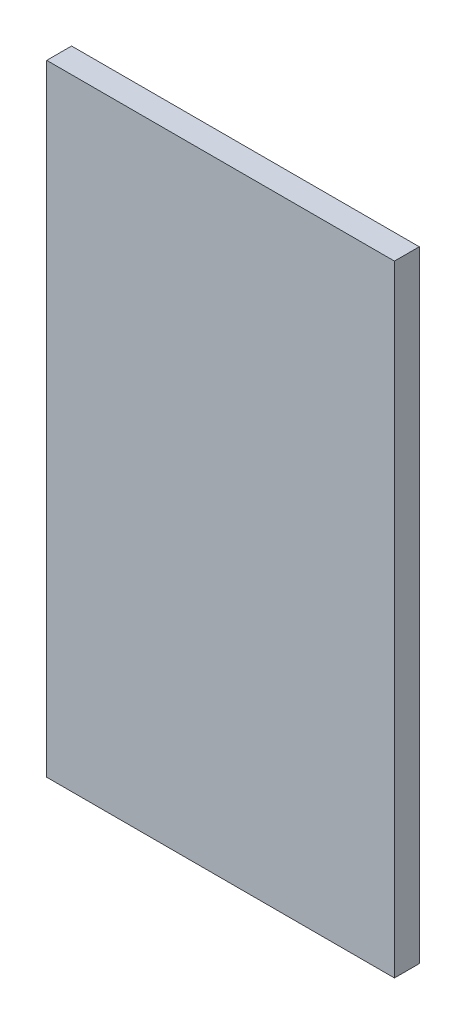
ISO-10303-21;
HEADER;
FILE_DESCRIPTION(('STEP AP214'),'2;1');
FILE_NAME('part.step','',(''),(''),'','','');
FILE_SCHEMA(('AUTOMOTIVE_DESIGN { 1 0 10303 214 1 1 1 1 }'));
ENDSEC;
DATA;
#1=APPLICATION_CONTEXT('core data for automotive mechanical design processes');
#2=APPLICATION_PROTOCOL_DEFINITION('international standard','automotive_design',2000,#1);
#3=PRODUCT_CONTEXT('',#1,'mechanical');
#4=PRODUCT('Part','Part','',(#3));
#5=PRODUCT_RELATED_PRODUCT_CATEGORY('part','',(#4));
#6=PRODUCT_DEFINITION_FORMATION('','',#4);
#7=PRODUCT_DEFINITION_CONTEXT('part definition',#1,'design');
#8=PRODUCT_DEFINITION('design','',#6,#7);
#9=PRODUCT_DEFINITION_SHAPE('','',#8);
#10=(LENGTH_UNIT() NAMED_UNIT(*) SI_UNIT(.MILLI.,.METRE.));
#11=(NAMED_UNIT(*) PLANE_ANGLE_UNIT() SI_UNIT($,.RADIAN.));
#12=(NAMED_UNIT(*) SI_UNIT($,.STERADIAN.) SOLID_ANGLE_UNIT());
#13=UNCERTAINTY_MEASURE_WITH_UNIT(LENGTH_MEASURE(1.E-05),#10,'distance_accuracy_value','');
#14=(GEOMETRIC_REPRESENTATION_CONTEXT(3) GLOBAL_UNCERTAINTY_ASSIGNED_CONTEXT((#13)) GLOBAL_UNIT_ASSIGNED_CONTEXT((#10,
#11,#12)) REPRESENTATION_CONTEXT('',''));
#15=CARTESIAN_POINT('',(0.,0.,0.));
#16=DIRECTION('',(0.,0.,1.));
#17=DIRECTION('',(1.,0.,0.));
#18=AXIS2_PLACEMENT_3D('',#15,#16,#17);
#19=CARTESIAN_POINT('',(21.,-37.5,-1.5));
#20=DIRECTION('',(0.,0.,1.));
#21=DIRECTION('',(1.,0.,0.));
#22=AXIS2_PLACEMENT_3D('',#19,#20,#21);
#23=PLANE('',#22);
#24=DIRECTION('',(0.,1.,0.));
#25=VECTOR('',#24,1.);
#26=CARTESIAN_POINT('',(-21.,-37.5,-1.5));
#27=LINE('',#26,#25);
#28=CARTESIAN_POINT('',(-21.,-37.5,-1.5));
#29=VERTEX_POINT('',#28);
#30=CARTESIAN_POINT('',(-21.,37.5,-1.5));
#31=VERTEX_POINT('',#30);
#32=EDGE_CURVE('E95',#29,#31,#27,.T.);
#33=ORIENTED_EDGE('',*,*,#32,.T.);
#34=DIRECTION('',(-1.,0.,0.));
#35=VECTOR('',#34,1.);
#36=CARTESIAN_POINT('',(21.,37.5,-1.5));
#37=LINE('',#36,#35);
#38=CARTESIAN_POINT('',(21.,37.5,-1.5));
#39=VERTEX_POINT('',#38);
#40=EDGE_CURVE('E11',#39,#31,#37,.T.);
#41=ORIENTED_EDGE('',*,*,#40,.F.);
#42=DIRECTION('',(0.,1.,0.));
#43=VECTOR('',#42,1.);
#44=CARTESIAN_POINT('',(21.,-37.5,-1.5));
#45=LINE('',#44,#43);
#46=CARTESIAN_POINT('',(21.,-37.5,-1.5));
#47=VERTEX_POINT('',#46);
#48=EDGE_CURVE('E83',#47,#39,#45,.T.);
#49=ORIENTED_EDGE('',*,*,#48,.F.);
#50=DIRECTION('',(-1.,0.,0.));
#51=VECTOR('',#50,1.);
#52=CARTESIAN_POINT('',(21.,-37.5,-1.5));
#53=LINE('',#52,#51);
#54=EDGE_CURVE('E91',#47,#29,#53,.T.);
#55=ORIENTED_EDGE('',*,*,#54,.T.);
#56=EDGE_LOOP('',(#33,#41,#49,#55));
#57=FACE_BOUND('',#56,.T.);
#58=ADVANCED_FACE('F32',(#57),#23,.F.);
#59=CARTESIAN_POINT('',(21.,37.5,1.5));
#60=DIRECTION('',(0.,-1.,0.));
#61=DIRECTION('',(0.,0.,-1.));
#62=AXIS2_PLACEMENT_3D('',#59,#60,#61);
#63=PLANE('',#62);
#64=DIRECTION('',(0.,0.,1.));
#65=VECTOR('',#64,1.);
#66=CARTESIAN_POINT('',(-21.,37.5,1.5));
#67=LINE('',#66,#65);
#68=CARTESIAN_POINT('',(-21.,37.5,1.5));
#69=VERTEX_POINT('',#68);
#70=EDGE_CURVE('E87',#31,#69,#67,.T.);
#71=ORIENTED_EDGE('',*,*,#70,.T.);
#72=DIRECTION('',(-1.,0.,0.));
#73=VECTOR('',#72,1.);
#74=CARTESIAN_POINT('',(21.,37.5,1.5));
#75=LINE('',#74,#73);
#76=CARTESIAN_POINT('',(21.,37.5,1.5));
#77=VERTEX_POINT('',#76);
#78=EDGE_CURVE('E40',#77,#69,#75,.T.);
#79=ORIENTED_EDGE('',*,*,#78,.F.);
#80=DIRECTION('',(0.,0.,1.));
#81=VECTOR('',#80,1.);
#82=CARTESIAN_POINT('',(21.,37.5,1.5));
#83=LINE('',#82,#81);
#84=EDGE_CURVE('E78',#39,#77,#83,.T.);
#85=ORIENTED_EDGE('',*,*,#84,.F.);
#86=ORIENTED_EDGE('',*,*,#40,.T.);
#87=EDGE_LOOP('',(#71,#79,#85,#86));
#88=FACE_BOUND('',#87,.T.);
#89=ADVANCED_FACE('F86',(#88),#63,.F.);
#90=CARTESIAN_POINT('',(21.,-37.5,1.5));
#91=DIRECTION('',(0.,0.,-1.));
#92=DIRECTION('',(-1.,0.,0.));
#93=AXIS2_PLACEMENT_3D('',#90,#91,#92);
#94=PLANE('',#93);
#95=DIRECTION('',(0.,-1.,0.));
#96=VECTOR('',#95,1.);
#97=CARTESIAN_POINT('',(-21.,-37.5,1.5));
#98=LINE('',#97,#96);
#99=CARTESIAN_POINT('',(-21.,-37.5,1.5));
#100=VERTEX_POINT('',#99);
#101=EDGE_CURVE('E65',#69,#100,#98,.T.);
#102=ORIENTED_EDGE('',*,*,#101,.T.);
#103=DIRECTION('',(-1.,0.,0.));
#104=VECTOR('',#103,1.);
#105=CARTESIAN_POINT('',(21.,-37.5,1.5));
#106=LINE('',#105,#104);
#107=CARTESIAN_POINT('',(21.,-37.5,1.5));
#108=VERTEX_POINT('',#107);
#109=EDGE_CURVE('E88',#108,#100,#106,.T.);
#110=ORIENTED_EDGE('',*,*,#109,.F.);
#111=DIRECTION('',(0.,-1.,0.));
#112=VECTOR('',#111,1.);
#113=CARTESIAN_POINT('',(21.,-37.5,1.5));
#114=LINE('',#113,#112);
#115=EDGE_CURVE('E81',#77,#108,#114,.T.);
#116=ORIENTED_EDGE('',*,*,#115,.F.);
#117=ORIENTED_EDGE('',*,*,#78,.T.);
#118=EDGE_LOOP('',(#102,#110,#116,#117));
#119=FACE_BOUND('',#118,.T.);
#120=ADVANCED_FACE('F89',(#119),#94,.F.);
#121=CARTESIAN_POINT('',(21.,-37.5,1.5));
#122=DIRECTION('',(0.,1.,0.));
#123=DIRECTION('',(0.,0.,1.));
#124=AXIS2_PLACEMENT_3D('',#121,#122,#123);
#125=PLANE('',#124);
#126=DIRECTION('',(0.,0.,-1.));
#127=VECTOR('',#126,1.);
#128=CARTESIAN_POINT('',(-21.,-37.5,1.5));
#129=LINE('',#128,#127);
#130=EDGE_CURVE('E71',#100,#29,#129,.T.);
#131=ORIENTED_EDGE('',*,*,#130,.T.);
#132=ORIENTED_EDGE('',*,*,#54,.F.);
#133=DIRECTION('',(0.,0.,-1.));
#134=VECTOR('',#133,1.);
#135=CARTESIAN_POINT('',(21.,-37.5,1.5));
#136=LINE('',#135,#134);
#137=EDGE_CURVE('E48',#108,#47,#136,.T.);
#138=ORIENTED_EDGE('',*,*,#137,.F.);
#139=ORIENTED_EDGE('',*,*,#109,.T.);
#140=EDGE_LOOP('',(#131,#132,#138,#139));
#141=FACE_BOUND('',#140,.T.);
#142=ADVANCED_FACE('F102',(#141),#125,.F.);
#143=CARTESIAN_POINT('',(21.,0.,0.));
#144=DIRECTION('',(-1.,0.,0.));
#145=DIRECTION('',(0.,0.,1.));
#146=AXIS2_PLACEMENT_3D('',#143,#144,#145);
#147=PLANE('',#146);
#148=ORIENTED_EDGE('',*,*,#48,.T.);
#149=ORIENTED_EDGE('',*,*,#84,.T.);
#150=ORIENTED_EDGE('',*,*,#115,.T.);
#151=ORIENTED_EDGE('',*,*,#137,.T.);
#152=EDGE_LOOP('',(#148,#149,#150,#151));
#153=FACE_BOUND('',#152,.T.);
#154=ADVANCED_FACE('F79',(#153),#147,.F.);
#155=CARTESIAN_POINT('',(-21.,0.,0.));
#156=DIRECTION('',(-1.,0.,0.));
#157=DIRECTION('',(0.,0.,1.));
#158=AXIS2_PLACEMENT_3D('',#155,#156,#157);
#159=PLANE('',#158);
#160=ORIENTED_EDGE('',*,*,#32,.F.);
#161=ORIENTED_EDGE('',*,*,#130,.F.);
#162=ORIENTED_EDGE('',*,*,#101,.F.);
#163=ORIENTED_EDGE('',*,*,#70,.F.);
#164=EDGE_LOOP('',(#160,#161,#162,#163));
#165=FACE_BOUND('',#164,.T.);
#166=ADVANCED_FACE('F105',(#165),#159,.T.);
#167=CLOSED_SHELL('',(#58,#89,#120,#142,#154,#166));
#168=MANIFOLD_SOLID_BREP('B2',#167);
#169=ADVANCED_BREP_SHAPE_REPRESENTATION('',(#18,#168),#14);
#170=SHAPE_DEFINITION_REPRESENTATION(#9,#169);
ENDSEC;
END-ISO-10303-21;
